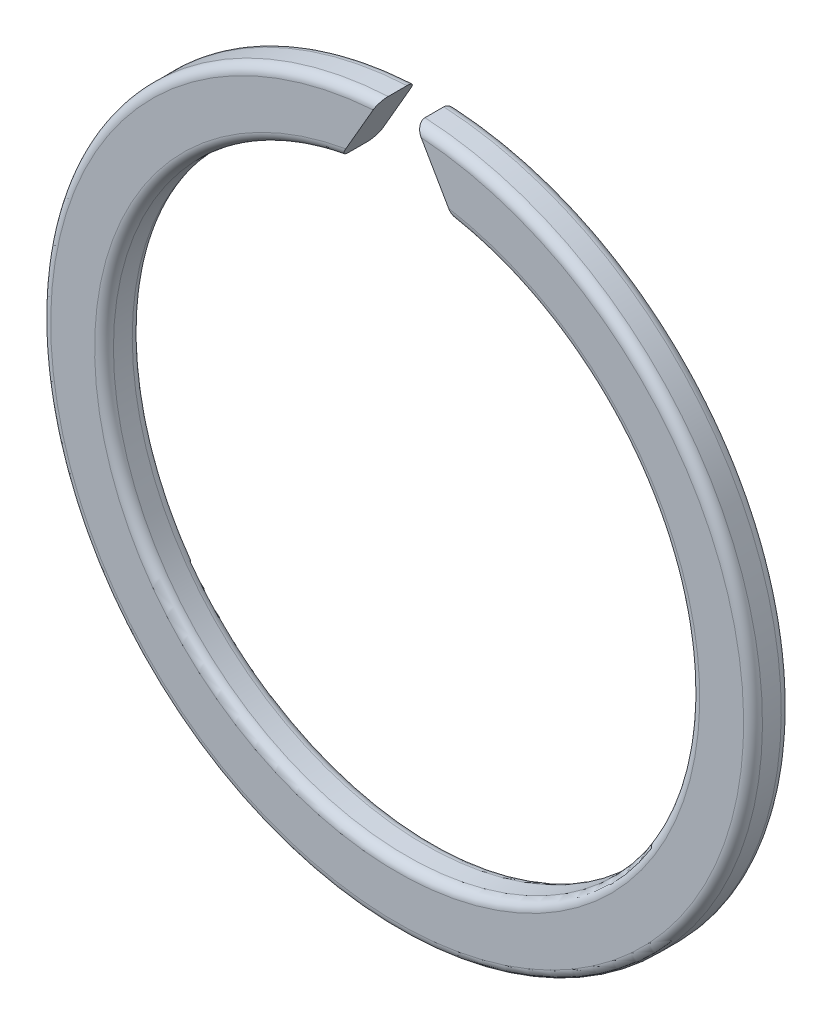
from build123d import *

# Parameters (mm, degrees)
BODYSKE_R      = 11.35
BODYSKE_R_2    = 9.35
BASEBODY_DEPTH = 1.2
SLIT_DEPTH     = 17.096117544
FILLET1_R      = 0.3


with BuildPart() as part:
    # BodySke → BaseBody (new body)
    with BuildSketch(Plane.XY):
        Circle(BODYSKE_R)
        Circle(BODYSKE_R_2, mode=Mode.SUBTRACT)
    extrude(amount=BASEBODY_DEPTH)

    # SlitSke → Slit (cut, through all)
    with BuildSketch(Plane.XY):
        Polygon((0, 12.35), (-1.837298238, 9.167706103), (1.837298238, 9.167706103), align=None)
    extrude(amount=SLIT_DEPTH, mode=Mode.SUBTRACT)

    # Fillet1
    fillet1_edges = [part.edges().sort_by_distance(p)[0] for p in [
        (0, -9.35, 1.2),
        (0, -9.35, 0),
        (-7.815700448, -8.230268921, 1.2),
        (-7.815700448, -8.230268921, 0),
    ]]
    fillet(fillet1_edges, radius=FILLET1_R)


solid = part.part
